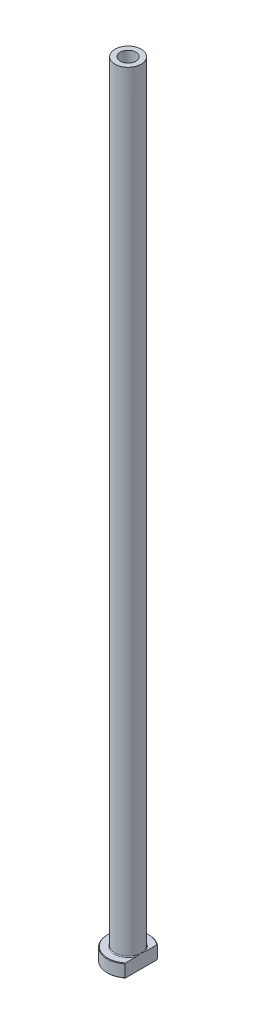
ISO-10303-21;
HEADER;
FILE_DESCRIPTION(('STEP AP214'),'2;1');
FILE_NAME('part.step','',(''),(''),'','','');
FILE_SCHEMA(('AUTOMOTIVE_DESIGN { 1 0 10303 214 1 1 1 1 }'));
ENDSEC;
DATA;
#1=APPLICATION_CONTEXT('core data for automotive mechanical design processes');
#2=APPLICATION_PROTOCOL_DEFINITION('international standard','automotive_design',2000,#1);
#3=PRODUCT_CONTEXT('',#1,'mechanical');
#4=PRODUCT('Part','Part','',(#3));
#5=PRODUCT_RELATED_PRODUCT_CATEGORY('part','',(#4));
#6=PRODUCT_DEFINITION_FORMATION('','',#4);
#7=PRODUCT_DEFINITION_CONTEXT('part definition',#1,'design');
#8=PRODUCT_DEFINITION('design','',#6,#7);
#9=PRODUCT_DEFINITION_SHAPE('','',#8);
#10=(LENGTH_UNIT() NAMED_UNIT(*) SI_UNIT(.MILLI.,.METRE.));
#11=(NAMED_UNIT(*) PLANE_ANGLE_UNIT() SI_UNIT($,.RADIAN.));
#12=(NAMED_UNIT(*) SI_UNIT($,.STERADIAN.) SOLID_ANGLE_UNIT());
#13=UNCERTAINTY_MEASURE_WITH_UNIT(LENGTH_MEASURE(1.E-05),#10,'distance_accuracy_value','');
#14=(GEOMETRIC_REPRESENTATION_CONTEXT(3) GLOBAL_UNCERTAINTY_ASSIGNED_CONTEXT((#13)) GLOBAL_UNIT_ASSIGNED_CONTEXT((#10,
#11,#12)) REPRESENTATION_CONTEXT('',''));
#15=CARTESIAN_POINT('',(0.,0.,0.));
#16=DIRECTION('',(0.,0.,1.));
#17=DIRECTION('',(1.,0.,0.));
#18=AXIS2_PLACEMENT_3D('',#15,#16,#17);
#19=CARTESIAN_POINT('',(0.,92.1876809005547,0.));
#20=DIRECTION('',(0.,1.,0.));
#21=DIRECTION('',(0.,0.,1.));
#22=AXIS2_PLACEMENT_3D('',#19,#20,#21);
#23=CYLINDRICAL_SURFACE('',#22,3.00000000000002);
#24=CARTESIAN_POINT('',(0.,300.,0.));
#25=DIRECTION('',(0.,1.,0.));
#26=DIRECTION('',(0.,0.,1.));
#27=AXIS2_PLACEMENT_3D('',#24,#25,#26);
#28=CIRCLE('',#27,3.00000000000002);
#29=CARTESIAN_POINT('',(0.,300.,3.00000000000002));
#30=VERTEX_POINT('',#29);
#31=EDGE_CURVE('E167',#30,#30,#28,.T.);
#32=ORIENTED_EDGE('',*,*,#31,.T.);
#33=EDGE_LOOP('',(#32));
#34=FACE_BOUND('',#33,.T.);
#35=CARTESIAN_POINT('',(0.,255.,0.));
#36=DIRECTION('',(0.,1.,0.));
#37=DIRECTION('',(0.,0.,1.));
#38=AXIS2_PLACEMENT_3D('',#35,#36,#37);
#39=CIRCLE('',#38,3.00000000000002);
#40=CARTESIAN_POINT('',(0.,255.,3.00000000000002));
#41=VERTEX_POINT('',#40);
#42=EDGE_CURVE('E170',#41,#41,#39,.T.);
#43=ORIENTED_EDGE('',*,*,#42,.F.);
#44=EDGE_LOOP('',(#43));
#45=FACE_BOUND('',#44,.T.);
#46=ADVANCED_FACE('F32',(#34,#45),#23,.F.);
#47=CARTESIAN_POINT('',(-3.00000000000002,300.,0.));
#48=DIRECTION('',(0.,1.,0.));
#49=DIRECTION('',(0.,0.,1.));
#50=AXIS2_PLACEMENT_3D('',#47,#48,#49);
#51=PLANE('',#50);
#52=CARTESIAN_POINT('',(0.,300.,0.));
#53=DIRECTION('',(0.,1.,0.));
#54=DIRECTION('',(0.,0.,1.));
#55=AXIS2_PLACEMENT_3D('',#52,#53,#54);
#56=CIRCLE('',#55,5.00000000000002);
#57=CARTESIAN_POINT('',(0.,300.,5.00000000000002));
#58=VERTEX_POINT('',#57);
#59=EDGE_CURVE('E174',#58,#58,#56,.T.);
#60=ORIENTED_EDGE('',*,*,#59,.T.);
#61=EDGE_LOOP('',(#60));
#62=FACE_BOUND('',#61,.T.);
#63=ORIENTED_EDGE('',*,*,#31,.F.);
#64=EDGE_LOOP('',(#63));
#65=FACE_BOUND('',#64,.T.);
#66=ADVANCED_FACE('F157',(#62,#65),#51,.T.);
#67=CARTESIAN_POINT('',(0.,92.1876809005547,0.));
#68=DIRECTION('',(0.,1.,0.));
#69=DIRECTION('',(0.,0.,1.));
#70=AXIS2_PLACEMENT_3D('',#67,#68,#69);
#71=CYLINDRICAL_SURFACE('',#70,5.00000000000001);
#72=CARTESIAN_POINT('',(0.,5.3,0.));
#73=DIRECTION('',(0.,1.,0.));
#74=DIRECTION('',(0.,0.,1.));
#75=AXIS2_PLACEMENT_3D('',#72,#73,#74);
#76=CIRCLE('',#75,5.00000000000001);
#77=CARTESIAN_POINT('',(5.,5.3,0.));
#78=VERTEX_POINT('',#77);
#79=EDGE_CURVE('E180',#78,#78,#76,.T.);
#80=ORIENTED_EDGE('',*,*,#79,.T.);
#81=EDGE_LOOP('',(#80));
#82=FACE_BOUND('',#81,.T.);
#83=ORIENTED_EDGE('',*,*,#59,.F.);
#84=EDGE_LOOP('',(#83));
#85=FACE_BOUND('',#84,.T.);
#86=ADVANCED_FACE('F162',(#82,#85),#71,.T.);
#87=CARTESIAN_POINT('',(-4.99999999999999,5.,0.));
#88=DIRECTION('',(0.,1.,0.));
#89=DIRECTION('',(0.,0.,1.));
#90=AXIS2_PLACEMENT_3D('',#87,#88,#89);
#91=PLANE('',#90);
#92=DIRECTION('',(0.,0.,1.));
#93=VECTOR('',#92,1.);
#94=CARTESIAN_POINT('',(5.,5.,0.));
#95=LINE('',#94,#93);
#96=CARTESIAN_POINT('',(5.,5.,-5.98665181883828));
#97=VERTEX_POINT('',#96);
#98=CARTESIAN_POINT('',(5.,5.,-1.75783958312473));
#99=VERTEX_POINT('',#98);
#100=EDGE_CURVE('E54',#97,#99,#95,.T.);
#101=ORIENTED_EDGE('',*,*,#100,.F.);
#102=CARTESIAN_POINT('',(0.,5.,0.));
#103=DIRECTION('',(0.,1.,0.));
#104=DIRECTION('',(0.,0.,1.));
#105=AXIS2_PLACEMENT_3D('',#102,#103,#104);
#106=CIRCLE('',#105,7.79999999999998);
#107=CARTESIAN_POINT('',(4.99999999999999,5.,5.98665181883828));
#108=VERTEX_POINT('',#107);
#109=EDGE_CURVE('E186',#97,#108,#106,.T.);
#110=ORIENTED_EDGE('',*,*,#109,.T.);
#111=CARTESIAN_POINT('',(5.,5.,1.75783958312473));
#112=VERTEX_POINT('',#111);
#113=EDGE_CURVE('E134',#112,#108,#95,.T.);
#114=ORIENTED_EDGE('',*,*,#113,.F.);
#115=CARTESIAN_POINT('',(0.,5.,0.));
#116=DIRECTION('',(0.,1.,0.));
#117=DIRECTION('',(0.,0.,1.));
#118=AXIS2_PLACEMENT_3D('',#115,#116,#117);
#119=CIRCLE('',#118,5.30000000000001);
#120=EDGE_CURVE('E183',#112,#99,#119,.F.);
#121=ORIENTED_EDGE('',*,*,#120,.T.);
#122=EDGE_LOOP('',(#101,#110,#114,#121));
#123=FACE_BOUND('',#122,.T.);
#124=ADVANCED_FACE('F197',(#123),#91,.T.);
#125=CARTESIAN_POINT('',(0.,92.1876809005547,0.));
#126=DIRECTION('',(0.,1.,0.));
#127=DIRECTION('',(0.,0.,1.));
#128=AXIS2_PLACEMENT_3D('',#125,#126,#127);
#129=CYLINDRICAL_SURFACE('',#128,7.99999999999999);
#130=DIRECTION('',(0.,-1.,0.));
#131=VECTOR('',#130,1.);
#132=CARTESIAN_POINT('',(4.99999999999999,300.,6.24499799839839));
#133=LINE('',#132,#131);
#134=CARTESIAN_POINT('',(4.99999999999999,4.79999999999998,6.24499799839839));
#135=VERTEX_POINT('',#134);
#136=CARTESIAN_POINT('',(4.99999999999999,0.199999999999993,6.24499799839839));
#137=VERTEX_POINT('',#136);
#138=EDGE_CURVE('E82',#135,#137,#133,.T.);
#139=ORIENTED_EDGE('',*,*,#138,.F.);
#140=CARTESIAN_POINT('',(0.,4.79999999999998,0.));
#141=DIRECTION('',(0.,1.,0.));
#142=DIRECTION('',(0.,0.,1.));
#143=AXIS2_PLACEMENT_3D('',#140,#141,#142);
#144=CIRCLE('',#143,7.99999999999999);
#145=CARTESIAN_POINT('',(5.,4.79999999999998,-6.24499799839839));
#146=VERTEX_POINT('',#145);
#147=EDGE_CURVE('E95',#135,#146,#144,.F.);
#148=ORIENTED_EDGE('',*,*,#147,.T.);
#149=DIRECTION('',(0.,-1.,0.));
#150=VECTOR('',#149,1.);
#151=CARTESIAN_POINT('',(5.,300.,-6.24499799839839));
#152=LINE('',#151,#150);
#153=CARTESIAN_POINT('',(5.,0.199999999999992,-6.24499799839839));
#154=VERTEX_POINT('',#153);
#155=EDGE_CURVE('E192',#146,#154,#152,.T.);
#156=ORIENTED_EDGE('',*,*,#155,.T.);
#157=CARTESIAN_POINT('',(0.,0.199999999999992,0.));
#158=DIRECTION('',(0.,-1.,0.));
#159=DIRECTION('',(0.,0.,-1.));
#160=AXIS2_PLACEMENT_3D('',#157,#158,#159);
#161=CIRCLE('',#160,7.99999999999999);
#162=EDGE_CURVE('E98',#154,#137,#161,.F.);
#163=ORIENTED_EDGE('',*,*,#162,.T.);
#164=EDGE_LOOP('',(#139,#148,#156,#163));
#165=FACE_BOUND('',#164,.T.);
#166=ADVANCED_FACE('F190',(#165),#129,.T.);
#167=CARTESIAN_POINT('',(-7.99999999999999,0.,0.));
#168=DIRECTION('',(0.,-1.,0.));
#169=DIRECTION('',(0.,0.,-1.));
#170=AXIS2_PLACEMENT_3D('',#167,#168,#169);
#171=PLANE('',#170);
#172=CARTESIAN_POINT('',(0.,0.,0.));
#173=DIRECTION('',(0.,-1.,0.));
#174=DIRECTION('',(0.,0.,-1.));
#175=AXIS2_PLACEMENT_3D('',#172,#173,#174);
#176=CIRCLE('',#175,3.74999999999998);
#177=CARTESIAN_POINT('',(0.,0.,-3.74999999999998));
#178=VERTEX_POINT('',#177);
#179=EDGE_CURVE('E40',#178,#178,#176,.F.);
#180=ORIENTED_EDGE('',*,*,#179,.T.);
#181=EDGE_LOOP('',(#180));
#182=FACE_BOUND('',#181,.T.);
#183=DIRECTION('',(0.,0.,-1.));
#184=VECTOR('',#183,1.);
#185=CARTESIAN_POINT('',(4.99999999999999,0.,6.24499799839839));
#186=LINE('',#185,#184);
#187=CARTESIAN_POINT('',(4.99999999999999,0.,5.98665181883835));
#188=VERTEX_POINT('',#187);
#189=CARTESIAN_POINT('',(5.,0.,-5.98665181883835));
#190=VERTEX_POINT('',#189);
#191=EDGE_CURVE('E47',#188,#190,#186,.T.);
#192=ORIENTED_EDGE('',*,*,#191,.F.);
#193=CARTESIAN_POINT('',(0.,0.,0.));
#194=DIRECTION('',(0.,-1.,0.));
#195=DIRECTION('',(0.,0.,-1.));
#196=AXIS2_PLACEMENT_3D('',#193,#194,#195);
#197=CIRCLE('',#196,7.80000000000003);
#198=EDGE_CURVE('E92',#188,#190,#197,.T.);
#199=ORIENTED_EDGE('',*,*,#198,.T.);
#200=EDGE_LOOP('',(#192,#199));
#201=FACE_BOUND('',#200,.T.);
#202=ADVANCED_FACE('F91',(#182,#201),#171,.T.);
#203=CARTESIAN_POINT('',(0.,92.1876809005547,0.));
#204=DIRECTION('',(0.,1.,0.));
#205=DIRECTION('',(0.,0.,1.));
#206=AXIS2_PLACEMENT_3D('',#203,#204,#205);
#207=CYLINDRICAL_SURFACE('',#206,3.25);
#208=CARTESIAN_POINT('',(0.,0.499999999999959,0.));
#209=DIRECTION('',(0.,-1.,0.));
#210=DIRECTION('',(0.,0.,-1.));
#211=AXIS2_PLACEMENT_3D('',#208,#209,#210);
#212=CIRCLE('',#211,3.25);
#213=CARTESIAN_POINT('',(0.,0.499999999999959,-3.25));
#214=VERTEX_POINT('',#213);
#215=EDGE_CURVE('E11',#214,#214,#212,.T.);
#216=ORIENTED_EDGE('',*,*,#215,.T.);
#217=EDGE_LOOP('',(#216));
#218=FACE_BOUND('',#217,.T.);
#219=CARTESIAN_POINT('',(0.,243.,0.));
#220=DIRECTION('',(0.,1.,0.));
#221=DIRECTION('',(0.,0.,1.));
#222=AXIS2_PLACEMENT_3D('',#219,#220,#221);
#223=CIRCLE('',#222,3.25000000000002);
#224=CARTESIAN_POINT('',(0.,243.,3.25000000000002));
#225=VERTEX_POINT('',#224);
#226=EDGE_CURVE('E172',#225,#225,#223,.T.);
#227=ORIENTED_EDGE('',*,*,#226,.T.);
#228=EDGE_LOOP('',(#227));
#229=FACE_BOUND('',#228,.T.);
#230=ADVANCED_FACE('F215',(#218,#229),#207,.F.);
#231=CARTESIAN_POINT('',(0.,243.,0.));
#232=DIRECTION('',(0.,-1.,0.));
#233=DIRECTION('',(0.,0.,-1.));
#234=AXIS2_PLACEMENT_3D('',#231,#232,#233);
#235=CONICAL_SURFACE('',#234,3.25000000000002,0.0208303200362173);
#236=ORIENTED_EDGE('',*,*,#42,.T.);
#237=EDGE_LOOP('',(#236));
#238=FACE_BOUND('',#237,.T.);
#239=ORIENTED_EDGE('',*,*,#226,.F.);
#240=EDGE_LOOP('',(#239));
#241=FACE_BOUND('',#240,.T.);
#242=ADVANCED_FACE('F111',(#238,#241),#235,.F.);
#243=CARTESIAN_POINT('',(0.,5.3,0.));
#244=DIRECTION('',(0.,1.,0.));
#245=DIRECTION('',(0.,0.,1.));
#246=AXIS2_PLACEMENT_3D('',#243,#244,#245);
#247=TOROIDAL_SURFACE('',#246,5.30000000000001,0.3);
#248=ORIENTED_EDGE('',*,*,#120,.F.);
#249=CARTESIAN_POINT('',(5.,5.3,0.));
#250=CARTESIAN_POINT('',(5.,5.30000062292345,-1.31469010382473E-10));
#251=CARTESIAN_POINT('',(5.,5.30000124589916,2.52759437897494E-07));
#252=CARTESIAN_POINT('',(5.,5.30000240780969,9.47164796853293E-07));
#253=CARTESIAN_POINT('',(5.,5.30000293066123,1.40594088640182E-06));
#254=CARTESIAN_POINT('',(5.,5.30000402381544,2.50637678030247E-06));
#255=CARTESIAN_POINT('',(5.,5.30000457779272,3.16588995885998E-06));
#256=CARTESIAN_POINT('',(5.,5.3000055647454,4.52860063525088E-06));
#257=CARTESIAN_POINT('',(5.,5.30000600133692,5.22939539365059E-06));
#258=CARTESIAN_POINT('',(5.,5.30000763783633,7.96122138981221E-06));
#259=CARTESIAN_POINT('',(5.,5.30000875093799,1.00477429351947E-05));
#260=CARTESIAN_POINT('',(5.,5.30001056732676,1.41660896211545E-05));
#261=CARTESIAN_POINT('',(5.,5.30001129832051,1.61861803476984E-05));
#262=CARTESIAN_POINT('',(5.,5.30001439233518,2.47865774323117E-05));
#263=CARTESIAN_POINT('',(5.,5.30001672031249,3.13830329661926E-05));
#264=CARTESIAN_POINT('',(5.,5.30002012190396,4.38084273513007E-05));
#265=CARTESIAN_POINT('',(5.,5.30002133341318,4.95992786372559E-05));
#266=CARTESIAN_POINT('',(4.99999999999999,5.30003020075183,9.27862687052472E-05));
#267=CARTESIAN_POINT('',(5.,5.30003696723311,0.000130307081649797));
#268=CARTESIAN_POINT('',(5.,5.30006659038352,0.000278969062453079));
#269=CARTESIAN_POINT('',(5.,5.30009481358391,0.000389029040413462));
#270=CARTESIAN_POINT('',(4.99999999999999,5.30020506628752,0.000826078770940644));
#271=CARTESIAN_POINT('',(5.,5.30028365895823,0.00115365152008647));
#272=CARTESIAN_POINT('',(5.,5.30059919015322,0.00245925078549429));
#273=CARTESIAN_POINT('',(5.,5.3008404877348,0.00343651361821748));
#274=CARTESIAN_POINT('',(4.99999999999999,5.30184626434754,0.00752058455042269));
#275=CARTESIAN_POINT('',(4.99999999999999,5.30260525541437,0.0106283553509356));
#276=CARTESIAN_POINT('',(5.,5.30996461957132,0.0407482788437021));
#277=CARTESIAN_POINT('',(5.,5.31658985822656,0.0677561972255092));
#278=CARTESIAN_POINT('',(4.99999999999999,5.32953319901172,0.120688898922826));
#279=CARTESIAN_POINT('',(5.,5.33585289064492,0.146613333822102));
#280=CARTESIAN_POINT('',(5.,5.34926050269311,0.20179565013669));
#281=CARTESIAN_POINT('',(5.,5.35634306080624,0.231054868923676));
#282=CARTESIAN_POINT('',(5.,5.37050252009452,0.289917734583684));
#283=CARTESIAN_POINT('',(5.,5.37757848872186,0.319521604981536));
#284=CARTESIAN_POINT('',(5.,5.39452602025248,0.391032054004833));
#285=CARTESIAN_POINT('',(5.,5.40434071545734,0.432952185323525));
#286=CARTESIAN_POINT('',(5.,5.42340141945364,0.515763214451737));
#287=CARTESIAN_POINT('',(5.,5.43265559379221,0.556652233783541));
#288=CARTESIAN_POINT('',(5.,5.45710553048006,0.667075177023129));
#289=CARTESIAN_POINT('',(5.,5.47194176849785,0.736689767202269));
#290=CARTESIAN_POINT('',(5.,5.5001822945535,0.876836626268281));
#291=CARTESIAN_POINT('',(5.,5.51357312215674,0.947371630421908));
#292=CARTESIAN_POINT('',(5.,5.53930921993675,1.0949732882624));
#293=CARTESIAN_POINT('',(5.,5.5514621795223,1.17207432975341));
#294=CARTESIAN_POINT('',(5.,5.57239669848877,1.32672649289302));
#295=CARTESIAN_POINT('',(5.,5.58117877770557,1.40427754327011));
#296=CARTESIAN_POINT('',(5.,5.59499725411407,1.56873827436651));
#297=CARTESIAN_POINT('',(5.,5.59948802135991,1.65570044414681));
#298=CARTESIAN_POINT('',(5.,5.60018885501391,1.78535304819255));
#299=CARTESIAN_POINT('',(5.,5.59945214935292,1.82802575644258));
#300=CARTESIAN_POINT('',(5.,5.59559364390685,1.91325081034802));
#301=CARTESIAN_POINT('',(5.,5.59247319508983,1.95580321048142));
#302=CARTESIAN_POINT('',(5.,5.58383242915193,2.03512365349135));
#303=CARTESIAN_POINT('',(5.,5.57867386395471,2.07192937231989));
#304=CARTESIAN_POINT('',(5.,5.56543793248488,2.14526756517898));
#305=CARTESIAN_POINT('',(5.,5.55734203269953,2.18179676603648));
#306=CARTESIAN_POINT('',(5.,5.53718005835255,2.25427226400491));
#307=CARTESIAN_POINT('',(5.,5.52507057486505,2.29020746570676));
#308=CARTESIAN_POINT('',(5.,5.50270928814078,2.34223029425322));
#309=CARTESIAN_POINT('',(5.,5.4945781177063,2.35922314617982));
#310=CARTESIAN_POINT('',(5.,5.47657809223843,2.39224900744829));
#311=CARTESIAN_POINT('',(5.,5.4667128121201,2.40828390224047));
#312=CARTESIAN_POINT('',(5.,5.44695893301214,2.4357946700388));
#313=CARTESIAN_POINT('',(5.,5.43745879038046,2.44754592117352));
#314=CARTESIAN_POINT('',(5.,5.41677914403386,2.46946476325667));
#315=CARTESIAN_POINT('',(5.,5.40560543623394,2.47963758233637));
#316=CARTESIAN_POINT('',(5.,5.38617750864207,2.49393642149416));
#317=CARTESIAN_POINT('',(5.,5.37851643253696,2.49886271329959));
#318=CARTESIAN_POINT('',(5.,5.36252740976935,2.50749953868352));
#319=CARTESIAN_POINT('',(5.,5.35419984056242,2.51121075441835));
#320=CARTESIAN_POINT('',(5.,5.33690648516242,2.51712941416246));
#321=CARTESIAN_POINT('',(5.,5.32793451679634,2.51931927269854));
#322=CARTESIAN_POINT('',(5.,5.3097357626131,2.52185978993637));
#323=CARTESIAN_POINT('',(5.,5.30050931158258,2.52221275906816));
#324=CARTESIAN_POINT('',(5.,5.28349166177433,2.52112455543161));
#325=CARTESIAN_POINT('',(5.,5.2756832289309,2.51993178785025));
#326=CARTESIAN_POINT('',(5.,5.26036860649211,2.51628294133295));
#327=CARTESIAN_POINT('',(5.,5.25286261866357,2.51382603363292));
#328=CARTESIAN_POINT('',(5.,5.23590266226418,2.50685484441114));
#329=CARTESIAN_POINT('',(5.,5.22661875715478,2.50192984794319));
#330=CARTESIAN_POINT('',(5.,5.20895514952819,2.49066548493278));
#331=CARTESIAN_POINT('',(5.,5.20057756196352,2.48432291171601));
#332=CARTESIAN_POINT('',(5.,5.17987008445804,2.46645212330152));
#333=CARTESIAN_POINT('',(5.,5.16824151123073,2.45411867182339));
#334=CARTESIAN_POINT('',(5.,5.14692461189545,2.42790849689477));
#335=CARTESIAN_POINT('',(5.,5.13723987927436,2.41402898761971));
#336=CARTESIAN_POINT('',(5.,5.11080706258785,2.37143175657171));
#337=CARTESIAN_POINT('',(5.,5.09628770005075,2.34134703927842));
#338=CARTESIAN_POINT('',(5.,5.07130349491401,2.27940731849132));
#339=CARTESIAN_POINT('',(5.,5.06087110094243,2.24754035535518));
#340=CARTESIAN_POINT('',(5.,5.03890359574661,2.16787245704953));
#341=CARTESIAN_POINT('',(5.,5.02913523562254,2.11959065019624));
#342=CARTESIAN_POINT('',(5.,5.01416953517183,2.02224928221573));
#343=CARTESIAN_POINT('',(5.,5.00898637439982,1.97318778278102));
#344=CARTESIAN_POINT('',(5.,5.00220823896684,1.87635767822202));
#345=CARTESIAN_POINT('',(5.,5.00050709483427,1.82859609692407));
#346=CARTESIAN_POINT('',(5.,4.99969104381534,1.73330165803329));
#347=CARTESIAN_POINT('',(5.,5.00056327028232,1.6857688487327));
#348=CARTESIAN_POINT('',(5.,5.00484296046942,1.57937770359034));
#349=CARTESIAN_POINT('',(5.,5.00880932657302,1.52054285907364));
#350=CARTESIAN_POINT('',(5.,5.01925964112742,1.40312974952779));
#351=CARTESIAN_POINT('',(5.,5.0257426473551,1.34455139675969));
#352=CARTESIAN_POINT('',(5.,5.04090087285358,1.22627662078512));
#353=CARTESIAN_POINT('',(5.,5.0496242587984,1.16658647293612));
#354=CARTESIAN_POINT('',(5.,5.06877923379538,1.04732463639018));
#355=CARTESIAN_POINT('',(5.,5.07921523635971,0.987753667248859));
#356=CARTESIAN_POINT('',(5.,5.10551698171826,0.846936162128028));
#357=CARTESIAN_POINT('',(5.,5.12196565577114,0.765799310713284));
#358=CARTESIAN_POINT('',(5.,5.15639716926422,0.604819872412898));
#359=CARTESIAN_POINT('',(4.99999999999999,5.17436050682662,0.52497303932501));
#360=CARTESIAN_POINT('',(5.,5.20921667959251,0.374726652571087));
#361=CARTESIAN_POINT('',(5.,5.225993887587,0.304300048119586));
#362=CARTESIAN_POINT('',(4.99999999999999,5.25191105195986,0.196907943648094));
#363=CARTESIAN_POINT('',(4.99999999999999,5.26090146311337,0.159905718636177));
#364=CARTESIAN_POINT('',(5.,5.27881854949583,0.0865164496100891));
#365=CARTESIAN_POINT('',(5.00000000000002,5.28774391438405,0.0501291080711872));
#366=CARTESIAN_POINT('',(4.99999999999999,5.2973962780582,0.0106218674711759));
#367=CARTESIAN_POINT('',(4.99999999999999,5.29815688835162,0.00750762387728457));
#368=CARTESIAN_POINT('',(5.,5.29916304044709,0.00342209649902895));
#369=CARTESIAN_POINT('',(5.,5.29940309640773,0.00244985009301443));
#370=CARTESIAN_POINT('',(4.99999999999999,5.29971711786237,0.00115049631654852));
#371=CARTESIAN_POINT('',(4.99999999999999,5.29979541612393,0.000824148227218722));
#372=CARTESIAN_POINT('',(5.,5.29990531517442,0.000388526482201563));
#373=CARTESIAN_POINT('',(5.,5.29993348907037,0.000278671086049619));
#374=CARTESIAN_POINT('',(4.99999999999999,5.29996306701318,0.000130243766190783));
#375=CARTESIAN_POINT('',(4.99999999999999,5.2999698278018,9.27511452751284E-05));
#376=CARTESIAN_POINT('',(5.,5.29997868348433,4.95929937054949E-05));
#377=CARTESIAN_POINT('',(5.,5.2999798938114,4.38036608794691E-05));
#378=CARTESIAN_POINT('',(5.,5.29998329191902,3.13814231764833E-05));
#379=CARTESIAN_POINT('',(5.,5.29998561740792,2.47865253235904E-05));
#380=CARTESIAN_POINT('',(5.,5.29998870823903,1.61877567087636E-05));
#381=CARTESIAN_POINT('',(5.,5.29998943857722,1.41677791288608E-05));
#382=CARTESIAN_POINT('',(5.,5.29999125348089,1.00495550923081E-05));
#383=CARTESIAN_POINT('',(5.,5.29999236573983,7.96302814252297E-06));
#384=CARTESIAN_POINT('',(5.,5.29999400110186,5.23107510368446E-06));
#385=CARTESIAN_POINT('',(5.,5.2999944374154,4.53021132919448E-06));
#386=CARTESIAN_POINT('',(5.,5.29999542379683,3.16731243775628E-06));
#387=CARTESIAN_POINT('',(5.,5.29999597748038,2.50767799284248E-06));
#388=CARTESIAN_POINT('',(5.,5.29999707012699,1.40695930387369E-06));
#389=CARTESIAN_POINT('',(5.,5.29999759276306,9.48032903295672E-07));
#390=CARTESIAN_POINT('',(5.,5.29999875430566,2.53244546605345E-07));
#391=CARTESIAN_POINT('',(5.,5.29999937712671,1.31459812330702E-10));
#392=CARTESIAN_POINT('',(5.,5.3,0.));
#393=B_SPLINE_CURVE_WITH_KNOTS('',3,(#249,#250,#251,#252,#253,#254,#255,#256,#257,#258,#259,
#260,#261,#262,#263,#264,#265,#266,#267,#268,#269,#270,#271,#272,#273,#274,#275,#276,#277,#278,
#279,#280,#281,#282,#283,#284,#285,#286,#287,#288,#289,#290,#291,#292,#293,#294,#295,#296,#297,
#298,#299,#300,#301,#302,#303,#304,#305,#306,#307,#308,#309,#310,#311,#312,#313,#314,#315,#316,
#317,#318,#319,#320,#321,#322,#323,#324,#325,#326,#327,#328,#329,#330,#331,#332,#333,#334,#335,
#336,#337,#338,#339,#340,#341,#342,#343,#344,#345,#346,#347,#348,#349,#350,#351,#352,#353,#354,
#355,#356,#357,#358,#359,#360,#361,#362,#363,#364,#365,#366,#367,#368,#369,#370,#371,#372,#373,
#374,#375,#376,#377,#378,#379,#380,#381,#382,#383,#384,#385,#386,#387,#388,#389,#390,#391,#392),
.UNSPECIFIED.,.T.,.F.,(4,2,2,2,2,2,2,2,2,2,2,2,2,2,2,2,2,2,2,2,2,2,2,2,2,2,2,2,2,2,2,2,2,2,2,2,
2,2,2,2,2,2,2,2,2,2,2,2,2,2,2,2,2,2,2,2,2,2,2,2,2,2,2,2,2,2,2,2,2,2,2,4),(0.,
1.88939046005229E-06,3.98058434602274E-06,6.54817954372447E-06,9.02403619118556E-06,
1.60938663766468E-05,2.25328087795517E-05,4.34843817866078E-05,6.12120063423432E-05,
0.00017562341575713,0.000516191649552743,0.00152710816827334,0.00454656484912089,
0.0141443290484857,0.0975679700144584,0.17761933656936,0.267931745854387,0.359245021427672,
0.488405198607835,0.614173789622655,0.827694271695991,1.04305715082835,1.27715608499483,
1.51121890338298,1.77214751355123,1.90013509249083,2.02805018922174,2.13945459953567,
2.25157451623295,2.3649489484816,2.42139235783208,2.47772074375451,2.5229380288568,
2.56800219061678,2.59524342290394,2.62246933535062,2.65000494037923,2.67750590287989,
2.70108948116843,2.72468854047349,2.75603978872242,2.78746268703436,2.83802806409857,
2.88868607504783,2.98834295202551,3.08877575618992,3.23618650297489,3.38405153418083,
3.52733651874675,3.66990630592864,3.84673903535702,4.02350562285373,4.20444776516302,
4.38586374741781,4.63419556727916,4.87971270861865,5.09690175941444,5.21113882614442,
5.32353360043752,5.33315137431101,5.33615533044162,5.33716246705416,5.33750240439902,
5.3376167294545,5.33763445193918,5.33765539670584,5.33766183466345,5.33766890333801,
5.33767137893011,5.33767394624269,5.33767603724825,5.33767792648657),.UNSPECIFIED.);
#394=EDGE_CURVE('E126',#112,#78,#393,.T.);
#395=ORIENTED_EDGE('',*,*,#394,.T.);
#396=ORIENTED_EDGE('',*,*,#79,.F.);
#397=CARTESIAN_POINT('',(5.,5.3,0.));
#398=CARTESIAN_POINT('',(5.,5.29999937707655,1.31470487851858E-10));
#399=CARTESIAN_POINT('',(5.,5.29999875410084,-2.52759436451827E-07));
#400=CARTESIAN_POINT('',(5.,5.29999759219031,-9.47164795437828E-07));
#401=CARTESIAN_POINT('',(5.,5.29999706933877,-1.40594088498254E-06));
#402=CARTESIAN_POINT('',(5.,5.29999597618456,-2.50637677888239E-06));
#403=CARTESIAN_POINT('',(5.,5.29999542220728,-3.16588995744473E-06));
#404=CARTESIAN_POINT('',(5.,5.29999443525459,-4.52860063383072E-06));
#405=CARTESIAN_POINT('',(5.,5.29999399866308,-5.22939539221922E-06));
#406=CARTESIAN_POINT('',(5.,5.29999236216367,-7.96122138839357E-06));
#407=CARTESIAN_POINT('',(5.,5.299991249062,-1.00477429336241E-05));
#408=CARTESIAN_POINT('',(5.,5.29998943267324,-1.4166089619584E-05));
#409=CARTESIAN_POINT('',(5.,5.29998870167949,-1.61861803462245E-05));
#410=CARTESIAN_POINT('',(5.,5.29998560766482,-2.47865774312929E-05));
#411=CARTESIAN_POINT('',(5.,5.29998327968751,-3.13830329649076E-05));
#412=CARTESIAN_POINT('',(5.,5.29997987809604,-4.38084273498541E-05));
#413=CARTESIAN_POINT('',(5.,5.29997866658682,-4.95992786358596E-05));
#414=CARTESIAN_POINT('',(5.,5.29996979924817,-9.27862687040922E-05));
#415=CARTESIAN_POINT('',(5.,5.29996303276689,-0.00013030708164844));
#416=CARTESIAN_POINT('',(4.99999999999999,5.29993340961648,-0.000278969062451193));
#417=CARTESIAN_POINT('',(4.99999999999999,5.29990518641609,-0.000389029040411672));
#418=CARTESIAN_POINT('',(5.,5.29979493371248,-0.000826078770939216));
#419=CARTESIAN_POINT('',(5.,5.29971634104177,-0.00115365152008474));
#420=CARTESIAN_POINT('',(4.99999999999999,5.29940080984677,-0.00245925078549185));
#421=CARTESIAN_POINT('',(4.99999999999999,5.29915951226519,-0.00343651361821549));
#422=CARTESIAN_POINT('',(5.00000000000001,5.29815373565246,-0.00752058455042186));
#423=CARTESIAN_POINT('',(5.,5.29739474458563,-0.0106283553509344));
#424=CARTESIAN_POINT('',(4.99999999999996,5.29003538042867,-0.0407482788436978));
#425=CARTESIAN_POINT('',(4.99999999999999,5.28341014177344,-0.0677561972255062));
#426=CARTESIAN_POINT('',(5.00000000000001,5.27046680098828,-0.120688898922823));
#427=CARTESIAN_POINT('',(5.,5.26414710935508,-0.146613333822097));
#428=CARTESIAN_POINT('',(4.99999999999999,5.25073949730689,-0.201795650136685));
#429=CARTESIAN_POINT('',(4.99999999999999,5.24365693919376,-0.231054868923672));
#430=CARTESIAN_POINT('',(5.,5.22949747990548,-0.289917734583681));
#431=CARTESIAN_POINT('',(5.,5.22242151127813,-0.319521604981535));
#432=CARTESIAN_POINT('',(5.,5.20547397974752,-0.391032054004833));
#433=CARTESIAN_POINT('',(5.,5.19565928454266,-0.432952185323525));
#434=CARTESIAN_POINT('',(5.,5.17659858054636,-0.515763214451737));
#435=CARTESIAN_POINT('',(5.,5.16734440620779,-0.55665223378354));
#436=CARTESIAN_POINT('',(5.,5.14289446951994,-0.667075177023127));
#437=CARTESIAN_POINT('',(5.,5.12805823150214,-0.736689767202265));
#438=CARTESIAN_POINT('',(5.,5.0998177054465,-0.876836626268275));
#439=CARTESIAN_POINT('',(5.,5.08642687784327,-0.947371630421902));
#440=CARTESIAN_POINT('',(5.,5.06069078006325,-1.0949732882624));
#441=CARTESIAN_POINT('',(5.,5.0485378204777,-1.1720743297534));
#442=CARTESIAN_POINT('',(5.,5.02760330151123,-1.32672649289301));
#443=CARTESIAN_POINT('',(5.,5.01882122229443,-1.4042775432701));
#444=CARTESIAN_POINT('',(5.,5.00500274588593,-1.56873827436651));
#445=CARTESIAN_POINT('',(5.,5.00051197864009,-1.6557004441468));
#446=CARTESIAN_POINT('',(5.,4.99981114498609,-1.78535304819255));
#447=CARTESIAN_POINT('',(5.,5.00054785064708,-1.82802575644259));
#448=CARTESIAN_POINT('',(5.,5.00440635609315,-1.91325081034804));
#449=CARTESIAN_POINT('',(5.,5.00752680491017,-1.95580321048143));
#450=CARTESIAN_POINT('',(5.,5.01616757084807,-2.03512365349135));
#451=CARTESIAN_POINT('',(5.,5.02132613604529,-2.0719293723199));
#452=CARTESIAN_POINT('',(5.,5.03456206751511,-2.14526756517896));
#453=CARTESIAN_POINT('',(5.,5.04265796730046,-2.18179676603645));
#454=CARTESIAN_POINT('',(5.,5.06281994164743,-2.25427226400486));
#455=CARTESIAN_POINT('',(5.,5.07492942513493,-2.2902074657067));
#456=CARTESIAN_POINT('',(5.,5.09729071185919,-2.34223029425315));
#457=CARTESIAN_POINT('',(5.,5.10542188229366,-2.35922314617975));
#458=CARTESIAN_POINT('',(5.,5.12342190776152,-2.39224900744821));
#459=CARTESIAN_POINT('',(5.,5.13328718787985,-2.4082839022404));
#460=CARTESIAN_POINT('',(5.,5.1530410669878,-2.43579467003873));
#461=CARTESIAN_POINT('',(5.,5.16254120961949,-2.44754592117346));
#462=CARTESIAN_POINT('',(5.,5.18322085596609,-2.46946476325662));
#463=CARTESIAN_POINT('',(5.,5.19439456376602,-2.47963758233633));
#464=CARTESIAN_POINT('',(5.,5.21382249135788,-2.49393642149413));
#465=CARTESIAN_POINT('',(5.,5.22148356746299,-2.49886271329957));
#466=CARTESIAN_POINT('',(5.,5.2374725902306,-2.50749953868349));
#467=CARTESIAN_POINT('',(5.,5.24580015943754,-2.51121075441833));
#468=CARTESIAN_POINT('',(5.,5.26309351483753,-2.51712941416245));
#469=CARTESIAN_POINT('',(5.,5.27206548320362,-2.51931927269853));
#470=CARTESIAN_POINT('',(5.,5.29026423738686,-2.52185978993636));
#471=CARTESIAN_POINT('',(5.,5.29949068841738,-2.52221275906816));
#472=CARTESIAN_POINT('',(5.,5.31650833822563,-2.52112455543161));
#473=CARTESIAN_POINT('',(5.,5.32431677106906,-2.51993178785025));
#474=CARTESIAN_POINT('',(5.,5.33963139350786,-2.51628294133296));
#475=CARTESIAN_POINT('',(5.,5.3471373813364,-2.51382603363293));
#476=CARTESIAN_POINT('',(5.,5.36409733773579,-2.50685484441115));
#477=CARTESIAN_POINT('',(5.,5.37338124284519,-2.50192984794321));
#478=CARTESIAN_POINT('',(5.,5.39104485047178,-2.4906654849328));
#479=CARTESIAN_POINT('',(5.,5.39942243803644,-2.48432291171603));
#480=CARTESIAN_POINT('',(5.,5.42012991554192,-2.46645212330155));
#481=CARTESIAN_POINT('',(5.,5.43175848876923,-2.45411867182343));
#482=CARTESIAN_POINT('',(5.,5.45307538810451,-2.42790849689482));
#483=CARTESIAN_POINT('',(5.,5.4627601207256,-2.41402898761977));
#484=CARTESIAN_POINT('',(5.,5.48919293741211,-2.37143175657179));
#485=CARTESIAN_POINT('',(5.,5.5037122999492,-2.34134703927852));
#486=CARTESIAN_POINT('',(5.,5.52869650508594,-2.27940731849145));
#487=CARTESIAN_POINT('',(5.,5.53912889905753,-2.24754035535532));
#488=CARTESIAN_POINT('',(5.,5.56109640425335,-2.16787245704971));
#489=CARTESIAN_POINT('',(5.,5.57086476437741,-2.11959065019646));
#490=CARTESIAN_POINT('',(5.,5.58583046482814,-2.02224928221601));
#491=CARTESIAN_POINT('',(5.,5.59101362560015,-1.97318778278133));
#492=CARTESIAN_POINT('',(5.,5.59779176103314,-1.87635767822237));
#493=CARTESIAN_POINT('',(5.,5.59949290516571,-1.82859609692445));
#494=CARTESIAN_POINT('',(5.,5.60030895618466,-1.73330165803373));
#495=CARTESIAN_POINT('',(5.,5.59943672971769,-1.68576884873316));
#496=CARTESIAN_POINT('',(5.,5.5951570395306,-1.57937770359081));
#497=CARTESIAN_POINT('',(5.,5.59119067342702,-1.52054285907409));
#498=CARTESIAN_POINT('',(5.,5.58074035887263,-1.40312974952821));
#499=CARTESIAN_POINT('',(5.,5.57425735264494,-1.34455139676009));
#500=CARTESIAN_POINT('',(5.,5.55909912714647,-1.22627662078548));
#501=CARTESIAN_POINT('',(5.,5.55037574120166,-1.16658647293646));
#502=CARTESIAN_POINT('',(5.,5.53122076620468,-1.04732463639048));
#503=CARTESIAN_POINT('',(5.,5.52078476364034,-0.987753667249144));
#504=CARTESIAN_POINT('',(5.,5.49448301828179,-0.846936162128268));
#505=CARTESIAN_POINT('',(4.99999999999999,5.4780343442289,-0.765799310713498));
#506=CARTESIAN_POINT('',(5.,5.44360283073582,-0.604819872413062));
#507=CARTESIAN_POINT('',(5.,5.42563949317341,-0.52497303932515));
#508=CARTESIAN_POINT('',(4.99999999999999,5.39078332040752,-0.374726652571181));
#509=CARTESIAN_POINT('',(4.99999999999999,5.37400611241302,-0.304300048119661));
#510=CARTESIAN_POINT('',(5.,5.34808894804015,-0.196907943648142));
#511=CARTESIAN_POINT('',(5.00000000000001,5.33909853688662,-0.159905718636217));
#512=CARTESIAN_POINT('',(4.99999999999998,5.32118145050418,-0.0865164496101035));
#513=CARTESIAN_POINT('',(4.99999999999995,5.312256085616,-0.0501291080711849));
#514=CARTESIAN_POINT('',(5.,5.3026037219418,-0.0106218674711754));
#515=CARTESIAN_POINT('',(5.,5.30184311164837,-0.00750762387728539));
#516=CARTESIAN_POINT('',(4.99999999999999,5.3008369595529,-0.00342209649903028));
#517=CARTESIAN_POINT('',(4.99999999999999,5.30059690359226,-0.00244985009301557));
#518=CARTESIAN_POINT('',(5.,5.30028288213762,-0.00115049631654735));
#519=CARTESIAN_POINT('',(5.,5.30020458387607,-0.000824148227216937));
#520=CARTESIAN_POINT('',(4.99999999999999,5.30009468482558,-0.000388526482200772));
#521=CARTESIAN_POINT('',(4.99999999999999,5.30006651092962,-0.000278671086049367));
#522=CARTESIAN_POINT('',(5.,5.30003693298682,-0.000130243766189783));
#523=CARTESIAN_POINT('',(5.,5.3000301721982,-9.27511452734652E-05));
#524=CARTESIAN_POINT('',(5.,5.30002131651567,-4.95929937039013E-05));
#525=CARTESIAN_POINT('',(5.,5.30002010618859,-4.38036608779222E-05));
#526=CARTESIAN_POINT('',(5.,5.30001670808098,-3.13814231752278E-05));
#527=CARTESIAN_POINT('',(5.,5.30001438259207,-2.4786525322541E-05));
#528=CARTESIAN_POINT('',(5.,5.30001129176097,-1.61877567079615E-05));
#529=CARTESIAN_POINT('',(5.,5.30001056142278,-1.41677791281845E-05));
#530=CARTESIAN_POINT('',(5.,5.30000874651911,-1.0049555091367E-05));
#531=CARTESIAN_POINT('',(5.,5.30000763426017,-7.96302814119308E-06));
#532=CARTESIAN_POINT('',(5.,5.30000599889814,-5.23107510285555E-06));
#533=CARTESIAN_POINT('',(5.,5.3000055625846,-4.53021132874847E-06));
#534=CARTESIAN_POINT('',(5.,5.30000457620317,-3.16731243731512E-06));
#535=CARTESIAN_POINT('',(5.,5.30000402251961,-2.50767799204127E-06));
#536=CARTESIAN_POINT('',(5.,5.30000292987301,-1.40695930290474E-06));
#537=CARTESIAN_POINT('',(5.,5.30000240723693,-9.48032902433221E-07));
#538=CARTESIAN_POINT('',(5.,5.30000124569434,-2.53244545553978E-07));
#539=CARTESIAN_POINT('',(5.,5.30000062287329,-1.3145851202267E-10));
#540=CARTESIAN_POINT('',(5.,5.3,0.));
#541=B_SPLINE_CURVE_WITH_KNOTS('',3,(#397,#398,#399,#400,#401,#402,#403,#404,#405,#406,#407,
#408,#409,#410,#411,#412,#413,#414,#415,#416,#417,#418,#419,#420,#421,#422,#423,#424,#425,#426,
#427,#428,#429,#430,#431,#432,#433,#434,#435,#436,#437,#438,#439,#440,#441,#442,#443,#444,#445,
#446,#447,#448,#449,#450,#451,#452,#453,#454,#455,#456,#457,#458,#459,#460,#461,#462,#463,#464,
#465,#466,#467,#468,#469,#470,#471,#472,#473,#474,#475,#476,#477,#478,#479,#480,#481,#482,#483,
#484,#485,#486,#487,#488,#489,#490,#491,#492,#493,#494,#495,#496,#497,#498,#499,#500,#501,#502,
#503,#504,#505,#506,#507,#508,#509,#510,#511,#512,#513,#514,#515,#516,#517,#518,#519,#520,#521,
#522,#523,#524,#525,#526,#527,#528,#529,#530,#531,#532,#533,#534,#535,#536,#537,#538,#539,#540),
.UNSPECIFIED.,.T.,.F.,(4,2,2,2,2,2,2,2,2,2,2,2,2,2,2,2,2,2,2,2,2,2,2,2,2,2,2,2,2,2,2,2,2,2,2,2,
2,2,2,2,2,2,2,2,2,2,2,2,2,2,2,2,2,2,2,2,2,2,2,2,2,2,2,2,2,2,2,2,2,2,2,4),(0.,
1.8893904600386E-06,3.98058434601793E-06,6.54817954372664E-06,9.02403619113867E-06,
1.60938663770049E-05,2.25328087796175E-05,4.34843817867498E-05,6.12120063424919E-05,
0.000175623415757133,0.000516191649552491,0.00152710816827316,0.00454656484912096,
0.0141443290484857,0.0975679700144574,0.177619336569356,0.267931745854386,0.359245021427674,
0.488405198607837,0.614173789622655,0.827694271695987,1.04305715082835,1.27715608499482,
1.51121890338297,1.77214751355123,1.90013509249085,2.02805018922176,2.13945459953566,
2.25157451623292,2.36494894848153,2.421392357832,2.47772074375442,2.52293802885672,
2.56800219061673,2.59524342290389,2.62246933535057,2.65000494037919,2.67750590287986,
2.7010894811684,2.72468854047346,2.75603978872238,2.78746268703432,2.8380280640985,
2.88868607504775,2.98834295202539,3.08877575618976,3.23618650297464,3.38405153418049,
3.52733651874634,3.66990630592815,3.84673903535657,4.02350562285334,4.20444776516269,
4.38586374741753,4.63419556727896,4.87971270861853,5.09690175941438,5.21113882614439,
5.32353360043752,5.33315137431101,5.33615533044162,5.33716246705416,5.33750240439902,
5.3376167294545,5.33763445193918,5.33765539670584,5.33766183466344,5.33766890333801,
5.3376713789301,5.33767394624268,5.33767603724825,5.33767792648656),.UNSPECIFIED.);
#542=EDGE_CURVE('E135',#78,#99,#541,.T.);
#543=ORIENTED_EDGE('',*,*,#542,.T.);
#544=EDGE_LOOP('',(#248,#395,#396,#543));
#545=FACE_BOUND('',#544,.T.);
#546=ADVANCED_FACE('F141',(#545),#247,.F.);
#547=CARTESIAN_POINT('',(0.,5.,0.));
#548=DIRECTION('',(0.,-1.,0.));
#549=DIRECTION('',(0.,0.,-1.));
#550=AXIS2_PLACEMENT_3D('',#547,#548,#549);
#551=CONICAL_SURFACE('',#550,7.79999999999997,0.78539816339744);
#552=CARTESIAN_POINT('',(5.,-1.82162423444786,-13.7401563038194));
#553=CARTESIAN_POINT('',(5.,-1.61889813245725,-13.5244204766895));
#554=CARTESIAN_POINT('',(5.,-1.4164638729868,-13.3084101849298));
#555=CARTESIAN_POINT('',(5.,-1.01227657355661,-12.8757508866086));
#556=CARTESIAN_POINT('',(5.,-0.810523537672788,-12.6591018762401));
#557=CARTESIAN_POINT('',(5.,-0.206157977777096,-12.0077661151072));
#558=CARTESIAN_POINT('',(5.,0.195280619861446,-11.5719884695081));
#559=CARTESIAN_POINT('',(5.,1.00388282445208,-10.6856136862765));
#560=CARTESIAN_POINT('',(5.,1.4109390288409,-10.2349182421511));
#561=CARTESIAN_POINT('',(5.,2.01658324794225,-9.55471676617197));
#562=CARTESIAN_POINT('',(5.,2.21758236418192,-9.32735800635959));
#563=CARTESIAN_POINT('',(5.,2.61761142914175,-8.87091599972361));
#564=CARTESIAN_POINT('',(5.,2.8166413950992,-8.64183276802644));
#565=CARTESIAN_POINT('',(5.,3.21217345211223,-8.18170099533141));
#566=CARTESIAN_POINT('',(5.,3.4086768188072,-7.95065355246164));
#567=CARTESIAN_POINT('',(5.,3.79865427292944,-7.48599989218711));
#568=CARTESIAN_POINT('',(5.,3.9921282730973,-7.25239360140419));
#569=CARTESIAN_POINT('',(5.,4.37558160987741,-6.78155890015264));
#570=CARTESIAN_POINT('',(5.,4.56555334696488,-6.54432428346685));
#571=CARTESIAN_POINT('',(5.,4.94042138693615,-6.06589574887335));
#572=CARTESIAN_POINT('',(5.,5.125318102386,-5.82470215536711));
#573=CARTESIAN_POINT('',(5.,5.48653546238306,-5.33972956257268));
#574=CARTESIAN_POINT('',(5.,5.66292392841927,-5.09600137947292));
#575=CARTESIAN_POINT('',(5.,6.00675382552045,-4.60213647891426));
#576=CARTESIAN_POINT('',(5.,6.1741916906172,-4.35199726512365));
#577=CARTESIAN_POINT('',(5.,6.49592993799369,-3.84445040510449));
#578=CARTESIAN_POINT('',(5.,6.65027272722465,-3.58707012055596));
#579=CARTESIAN_POINT('',(5.,6.86813414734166,-3.19356592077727));
#580=CARTESIAN_POINT('',(5.,6.93845533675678,-3.06120993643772));
#581=CARTESIAN_POINT('',(5.,7.07360441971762,-2.7937331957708));
#582=CARTESIAN_POINT('',(5.,7.13843319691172,-2.65861288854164));
#583=CARTESIAN_POINT('',(5.,7.26869642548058,-2.36936389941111));
#584=CARTESIAN_POINT('',(5.,7.33331212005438,-2.21486278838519));
#585=CARTESIAN_POINT('',(5.,7.45243473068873,-1.90194073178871));
#586=CARTESIAN_POINT('',(5.,7.50694001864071,-1.74351915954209));
#587=CARTESIAN_POINT('',(5.,7.60343746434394,-1.42384276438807));
#588=CARTESIAN_POINT('',(5.,7.64549910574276,-1.26260921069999));
#589=CARTESIAN_POINT('',(5.,7.71543089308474,-0.937062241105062));
#590=CARTESIAN_POINT('',(5.,7.74330266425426,-0.77274918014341));
#591=CARTESIAN_POINT('',(5.,7.78344284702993,-0.439876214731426));
#592=CARTESIAN_POINT('',(5.,7.79548961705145,-0.271289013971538));
#593=CARTESIAN_POINT('',(5.,7.80240809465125,0.0662275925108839));
#594=CARTESIAN_POINT('',(5.,7.79728142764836,0.235156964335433));
#595=CARTESIAN_POINT('',(5.,7.77017954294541,0.572209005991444));
#596=CARTESIAN_POINT('',(5.,7.74814735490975,0.74032700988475));
#597=CARTESIAN_POINT('',(5.,7.68863212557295,1.07379849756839));
#598=CARTESIAN_POINT('',(5.,7.65114437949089,1.23915112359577));
#599=CARTESIAN_POINT('',(5.,7.54734433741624,1.62344926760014));
#600=CARTESIAN_POINT('',(5.,7.47553580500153,1.84089917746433));
#601=CARTESIAN_POINT('',(5.,7.31300119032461,2.26856946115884));
#602=CARTESIAN_POINT('',(5.,7.22226460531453,2.47878574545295));
#603=CARTESIAN_POINT('',(5.,7.07492970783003,2.79014067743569));
#604=CARTESIAN_POINT('',(5.,7.02362278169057,2.89384077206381));
#605=CARTESIAN_POINT('',(5.,6.91783840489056,3.09961626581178));
#606=CARTESIAN_POINT('',(4.99999999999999,6.86336091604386,3.20169164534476));
#607=CARTESIAN_POINT('',(4.99999999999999,6.75169048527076,3.40428995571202));
#608=CARTESIAN_POINT('',(4.99999999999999,6.69449856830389,3.50481345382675));
#609=CARTESIAN_POINT('',(4.99999999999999,6.57774196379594,3.70446206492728));
#610=CARTESIAN_POINT('',(4.99999999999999,6.51817739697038,3.80358724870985));
#611=CARTESIAN_POINT('',(4.99999999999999,6.30853654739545,4.14435766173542));
#612=CARTESIAN_POINT('',(4.99999999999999,6.15326588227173,4.38281352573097));
#613=CARTESIAN_POINT('',(4.99999999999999,5.83377190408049,4.85367607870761));
#614=CARTESIAN_POINT('',(4.99999999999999,5.66954595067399,5.08608095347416));
#615=CARTESIAN_POINT('',(4.99999999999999,5.3343169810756,5.5462855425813));
#616=CARTESIAN_POINT('',(4.99999999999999,5.16330740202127,5.77408045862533));
#617=CARTESIAN_POINT('',(4.99999999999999,4.8162992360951,6.22578157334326));
#618=CARTESIAN_POINT('',(4.99999999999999,4.64030119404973,6.44968819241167));
#619=CARTESIAN_POINT('',(4.99999999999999,4.28368615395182,6.8953257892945));
#620=CARTESIAN_POINT('',(4.99999999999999,4.10305289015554,7.11704371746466));
#621=CARTESIAN_POINT('',(4.99999999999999,3.7387071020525,7.55793799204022));
#622=CARTESIAN_POINT('',(4.99999999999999,3.55499450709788,7.77711427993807));
#623=CARTESIAN_POINT('',(4.99999999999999,3.18521083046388,8.21325328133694));
#624=CARTESIAN_POINT('',(4.99999999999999,2.99914113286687,8.43021717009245));
#625=CARTESIAN_POINT('',(4.99999999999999,2.6249981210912,8.86241167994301));
#626=CARTESIAN_POINT('',(4.99999999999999,2.43692478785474,9.07764228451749));
#627=CARTESIAN_POINT('',(4.99999999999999,1.91463404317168,9.67075518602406));
#628=CARTESIAN_POINT('',(4.99999999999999,1.57868086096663,10.0471086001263));
#629=CARTESIAN_POINT('',(4.99999999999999,0.903003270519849,10.7965122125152));
#630=CARTESIAN_POINT('',(4.99999999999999,0.563278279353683,11.169561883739));
#631=CARTESIAN_POINT('',(4.99999999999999,-0.116149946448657,11.9100168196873));
#632=CARTESIAN_POINT('',(4.99999999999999,-0.455830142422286,12.2774432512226));
#633=CARTESIAN_POINT('',(4.99999999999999,-1.13728640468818,13.0102135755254));
#634=CARTESIAN_POINT('',(4.99999999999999,-1.47906204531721,13.3755578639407));
#635=CARTESIAN_POINT('',(4.99999999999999,-1.82162423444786,13.7401563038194));
#636=B_SPLINE_CURVE_WITH_KNOTS('',3,(#552,#553,#554,#555,#556,#557,#558,#559,#560,#561,#562,
#563,#564,#565,#566,#567,#568,#569,#570,#571,#572,#573,#574,#575,#576,#577,#578,#579,#580,#581,
#582,#583,#584,#585,#586,#587,#588,#589,#590,#591,#592,#593,#594,#595,#596,#597,#598,#599,#600,
#601,#602,#603,#604,#605,#606,#607,#608,#609,#610,#611,#612,#613,#614,#615,#616,#617,#618,#619,
#620,#621,#622,#623,#624,#625,#626,#627,#628,#629,#630,#631,#632,#633,#634,#635),.UNSPECIFIED.,
.F.,.F.,(4,2,2,2,2,2,2,2,2,2,2,2,2,2,2,2,2,2,2,2,2,2,2,2,2,2,2,2,2,2,2,2,2,2,2,2,2,2,2,2,2,4),
(0.,0.888120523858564,1.77624635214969,3.55372511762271,5.3755948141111,6.28598924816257,
7.19637570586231,8.10628289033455,9.016216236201,9.92793449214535,10.8395784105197,
11.7420025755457,12.6447836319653,13.5445196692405,13.9940505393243,14.4435089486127,
14.9456212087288,15.4478142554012,15.947147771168,16.4464240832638,16.952621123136,
17.458770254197,17.966632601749,18.4746496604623,19.160451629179,19.8466351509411,
20.193687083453,20.5407431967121,20.8876692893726,21.234577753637,22.087909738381,
22.9414946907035,23.7959266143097,24.6502655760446,25.5081848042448,26.3661237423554,
27.2235803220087,28.0810450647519,29.5944656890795,31.1081235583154,32.60926785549,
34.1101167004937),.UNSPECIFIED.);
#637=EDGE_CURVE('E133',#146,#97,#636,.T.);
#638=ORIENTED_EDGE('',*,*,#637,.F.);
#639=ORIENTED_EDGE('',*,*,#147,.F.);
#640=EDGE_CURVE('E118',#108,#135,#636,.T.);
#641=ORIENTED_EDGE('',*,*,#640,.F.);
#642=ORIENTED_EDGE('',*,*,#109,.F.);
#643=EDGE_LOOP('',(#638,#639,#641,#642));
#644=FACE_BOUND('',#643,.T.);
#645=ADVANCED_FACE('F145',(#644),#551,.T.);
#646=CARTESIAN_POINT('',(0.,0.199999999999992,0.));
#647=DIRECTION('',(0.,1.,0.));
#648=DIRECTION('',(0.,0.,1.));
#649=AXIS2_PLACEMENT_3D('',#646,#647,#648);
#650=CONICAL_SURFACE('',#649,7.99999999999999,0.78539816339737);
#651=CARTESIAN_POINT('',(4.99999999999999,6.82162423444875,13.7401563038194));
#652=CARTESIAN_POINT('',(4.99999999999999,6.61889813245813,13.5244204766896));
#653=CARTESIAN_POINT('',(4.99999999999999,6.41646387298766,13.3084101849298));
#654=CARTESIAN_POINT('',(4.99999999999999,6.01227657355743,12.8757508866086));
#655=CARTESIAN_POINT('',(4.99999999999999,5.81052353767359,12.6591018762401));
#656=CARTESIAN_POINT('',(4.99999999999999,5.20615797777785,12.0077661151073));
#657=CARTESIAN_POINT('',(4.99999999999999,4.80471938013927,11.5719884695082));
#658=CARTESIAN_POINT('',(4.99999999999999,3.99611717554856,10.6856136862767));
#659=CARTESIAN_POINT('',(4.99999999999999,3.58906097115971,10.2349182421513));
#660=CARTESIAN_POINT('',(4.99999999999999,2.98341675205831,9.5547167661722));
#661=CARTESIAN_POINT('',(4.99999999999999,2.78241763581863,9.32735800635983));
#662=CARTESIAN_POINT('',(4.99999999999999,2.38238857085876,8.87091599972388));
#663=CARTESIAN_POINT('',(4.99999999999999,2.1833586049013,8.64183276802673));
#664=CARTESIAN_POINT('',(4.99999999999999,1.78782654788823,8.18170099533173));
#665=CARTESIAN_POINT('',(4.99999999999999,1.59132318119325,7.95065355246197));
#666=CARTESIAN_POINT('',(4.99999999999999,1.20134572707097,7.48599989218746));
#667=CARTESIAN_POINT('',(4.99999999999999,1.0078717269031,7.25239360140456));
#668=CARTESIAN_POINT('',(4.99999999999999,0.624418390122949,6.78155890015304));
#669=CARTESIAN_POINT('',(4.99999999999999,0.434446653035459,6.54432428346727));
#670=CARTESIAN_POINT('',(4.99999999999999,0.0595786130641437,6.06589574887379));
#671=CARTESIAN_POINT('',(4.99999999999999,-0.125318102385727,5.82470215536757));
#672=CARTESIAN_POINT('',(4.99999999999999,-0.486535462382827,5.33972956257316));
#673=CARTESIAN_POINT('',(4.99999999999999,-0.662923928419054,5.09600137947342));
#674=CARTESIAN_POINT('',(4.99999999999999,-1.00675382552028,4.60213647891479));
#675=CARTESIAN_POINT('',(4.99999999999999,-1.17419169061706,4.35199726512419));
#676=CARTESIAN_POINT('',(4.99999999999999,-1.49592993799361,3.84445040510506));
#677=CARTESIAN_POINT('',(4.99999999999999,-1.65027272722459,3.58707012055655));
#678=CARTESIAN_POINT('',(4.99999999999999,-1.86813414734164,3.19356592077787));
#679=CARTESIAN_POINT('',(5.,-1.93845533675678,3.06120993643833));
#680=CARTESIAN_POINT('',(5.,-2.07360441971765,2.79373319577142));
#681=CARTESIAN_POINT('',(5.,-2.13843319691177,2.65861288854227));
#682=CARTESIAN_POINT('',(5.,-2.26869642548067,2.36936389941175));
#683=CARTESIAN_POINT('',(5.,-2.33331212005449,2.21486278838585));
#684=CARTESIAN_POINT('',(5.,-2.45243473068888,1.90194073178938));
#685=CARTESIAN_POINT('',(5.,-2.50694001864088,1.74351915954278));
#686=CARTESIAN_POINT('',(5.,-2.60343746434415,1.42384276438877));
#687=CARTESIAN_POINT('',(5.,-2.645499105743,1.2626092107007));
#688=CARTESIAN_POINT('',(5.,-2.71543089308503,0.937062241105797));
#689=CARTESIAN_POINT('',(5.,-2.74330266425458,0.772749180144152));
#690=CARTESIAN_POINT('',(5.,-2.7834428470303,0.439876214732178));
#691=CARTESIAN_POINT('',(5.,-2.79548961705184,0.271289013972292));
#692=CARTESIAN_POINT('',(5.,-2.8024080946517,-0.0662275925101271));
#693=CARTESIAN_POINT('',(5.,-2.79728142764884,-0.235156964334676));
#694=CARTESIAN_POINT('',(5.,-2.77017954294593,-0.572209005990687));
#695=CARTESIAN_POINT('',(5.,-2.74814735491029,-0.740327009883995));
#696=CARTESIAN_POINT('',(5.,-2.68863212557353,-1.07379849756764));
#697=CARTESIAN_POINT('',(5.,-2.65114437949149,-1.23915112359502));
#698=CARTESIAN_POINT('',(5.,-2.54734433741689,-1.62344926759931));
#699=CARTESIAN_POINT('',(5.,-2.47553580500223,-1.84089917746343));
#700=CARTESIAN_POINT('',(5.,-2.31300119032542,-2.26856946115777));
#701=CARTESIAN_POINT('',(5.,-2.2222646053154,-2.47878574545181));
#702=CARTESIAN_POINT('',(5.,-2.07492970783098,-2.79014067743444));
#703=CARTESIAN_POINT('',(5.,-2.02362278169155,-2.89384077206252));
#704=CARTESIAN_POINT('',(5.,-1.91783840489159,-3.09961626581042));
#705=CARTESIAN_POINT('',(5.,-1.86336091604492,-3.20169164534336));
#706=CARTESIAN_POINT('',(5.,-1.75169048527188,-3.40428995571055));
#707=CARTESIAN_POINT('',(5.,-1.69449856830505,-3.50481345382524));
#708=CARTESIAN_POINT('',(5.,-1.57774196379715,-3.7044620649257));
#709=CARTESIAN_POINT('',(5.,-1.51817739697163,-3.80358724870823));
#710=CARTESIAN_POINT('',(5.,-1.30853654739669,-4.14435766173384));
#711=CARTESIAN_POINT('',(5.,-1.15326588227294,-4.38281352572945));
#712=CARTESIAN_POINT('',(5.,-0.833771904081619,-4.85367607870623));
#713=CARTESIAN_POINT('',(5.,-0.669545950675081,-5.08608095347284));
#714=CARTESIAN_POINT('',(5.,-0.334316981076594,-5.5462855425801));
#715=CARTESIAN_POINT('',(5.,-0.163307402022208,-5.77408045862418));
#716=CARTESIAN_POINT('',(5.,0.18370076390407,-6.22578157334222));
#717=CARTESIAN_POINT('',(5.,0.35969880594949,-6.44968819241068));
#718=CARTESIAN_POINT('',(5.,0.716313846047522,-6.89532578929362));
#719=CARTESIAN_POINT('',(5.,0.896947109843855,-7.11704371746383));
#720=CARTESIAN_POINT('',(5.,1.26129289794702,-7.55793799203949));
#721=CARTESIAN_POINT('',(5.,1.4450054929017,-7.77711427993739));
#722=CARTESIAN_POINT('',(5.,1.81478916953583,-8.21325328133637));
#723=CARTESIAN_POINT('',(5.,2.0008588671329,-8.43021717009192));
#724=CARTESIAN_POINT('',(5.,2.3750018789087,-8.86241167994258));
#725=CARTESIAN_POINT('',(5.,2.56307521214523,-9.07764228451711));
#726=CARTESIAN_POINT('',(5.,3.08536595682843,-9.67075518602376));
#727=CARTESIAN_POINT('',(5.,3.42131913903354,-10.047108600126));
#728=CARTESIAN_POINT('',(5.,4.09699672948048,-10.796512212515));
#729=CARTESIAN_POINT('',(5.,4.43672172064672,-11.1695618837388));
#730=CARTESIAN_POINT('',(5.,5.1161499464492,-11.9100168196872));
#731=CARTESIAN_POINT('',(5.,5.4558301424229,-12.2774432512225));
#732=CARTESIAN_POINT('',(5.,6.13728640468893,-13.0102135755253));
#733=CARTESIAN_POINT('',(5.,6.47906204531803,-13.3755578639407));
#734=CARTESIAN_POINT('',(5.,6.82162423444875,-13.7401563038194));
#735=B_SPLINE_CURVE_WITH_KNOTS('',3,(#651,#652,#653,#654,#655,#656,#657,#658,#659,#660,#661,
#662,#663,#664,#665,#666,#667,#668,#669,#670,#671,#672,#673,#674,#675,#676,#677,#678,#679,#680,
#681,#682,#683,#684,#685,#686,#687,#688,#689,#690,#691,#692,#693,#694,#695,#696,#697,#698,#699,
#700,#701,#702,#703,#704,#705,#706,#707,#708,#709,#710,#711,#712,#713,#714,#715,#716,#717,#718,
#719,#720,#721,#722,#723,#724,#725,#726,#727,#728,#729,#730,#731,#732,#733,#734),.UNSPECIFIED.,
.F.,.F.,(4,2,2,2,2,2,2,2,2,2,2,2,2,2,2,2,2,2,2,2,2,2,2,2,2,2,2,2,2,2,2,2,2,2,2,2,2,2,2,2,2,4),
(0.,0.888120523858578,1.77624635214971,3.55372511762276,5.37559481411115,6.28598924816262,
7.19637570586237,8.10628289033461,9.01621623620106,9.92793449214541,10.8395784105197,
11.7420025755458,12.6447836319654,13.5445196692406,13.9940505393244,14.4435089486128,
14.9456212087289,15.4478142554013,15.9471477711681,16.4464240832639,16.952621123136,
17.458770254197,17.9666326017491,18.4746496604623,19.1604516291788,19.8466351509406,
20.1936870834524,20.5407431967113,20.8876692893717,21.234577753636,22.0879097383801,
22.9414946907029,23.7959266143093,24.6502655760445,25.5081848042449,26.3661237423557,
27.2235803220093,28.0810450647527,29.5944656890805,31.1081235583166,32.6092678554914,
34.1101167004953),.UNSPECIFIED.);
#736=EDGE_CURVE('E79',#137,#188,#735,.T.);
#737=ORIENTED_EDGE('',*,*,#736,.F.);
#738=ORIENTED_EDGE('',*,*,#162,.F.);
#739=EDGE_CURVE('E87',#190,#154,#735,.T.);
#740=ORIENTED_EDGE('',*,*,#739,.F.);
#741=ORIENTED_EDGE('',*,*,#198,.F.);
#742=EDGE_LOOP('',(#737,#738,#740,#741));
#743=FACE_BOUND('',#742,.T.);
#744=ADVANCED_FACE('F94',(#743),#650,.T.);
#745=CARTESIAN_POINT('',(4.99999999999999,300.,6.24499799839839));
#746=DIRECTION('',(-1.,0.,0.));
#747=DIRECTION('',(0.,0.,1.));
#748=AXIS2_PLACEMENT_3D('',#745,#746,#747);
#749=PLANE('',#748);
#750=ORIENTED_EDGE('',*,*,#394,.F.);
#751=ORIENTED_EDGE('',*,*,#113,.T.);
#752=ORIENTED_EDGE('',*,*,#640,.T.);
#753=ORIENTED_EDGE('',*,*,#138,.T.);
#754=ORIENTED_EDGE('',*,*,#736,.T.);
#755=ORIENTED_EDGE('',*,*,#191,.T.);
#756=ORIENTED_EDGE('',*,*,#739,.T.);
#757=ORIENTED_EDGE('',*,*,#155,.F.);
#758=ORIENTED_EDGE('',*,*,#637,.T.);
#759=ORIENTED_EDGE('',*,*,#100,.T.);
#760=ORIENTED_EDGE('',*,*,#542,.F.);
#761=EDGE_LOOP('',(#750,#751,#752,#753,#754,#755,#756,#757,#758,#759,#760));
#762=FACE_BOUND('',#761,.T.);
#763=ADVANCED_FACE('F80',(#762),#749,.F.);
#764=CARTESIAN_POINT('',(0.,0.,0.));
#765=DIRECTION('',(0.,-1.,0.));
#766=DIRECTION('',(0.,0.,-1.));
#767=AXIS2_PLACEMENT_3D('',#764,#765,#766);
#768=CONICAL_SURFACE('',#767,3.74999999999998,0.78539816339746);
#769=ORIENTED_EDGE('',*,*,#215,.F.);
#770=EDGE_LOOP('',(#769));
#771=FACE_BOUND('',#770,.T.);
#772=ORIENTED_EDGE('',*,*,#179,.F.);
#773=EDGE_LOOP('',(#772));
#774=FACE_BOUND('',#773,.T.);
#775=ADVANCED_FACE('F34',(#771,#774),#768,.F.);
#776=CLOSED_SHELL('',(#46,#66,#86,#124,#166,#202,#230,#242,#546,#645,#744,#763,#775));
#777=MANIFOLD_SOLID_BREP('B2',#776);
#778=ADVANCED_BREP_SHAPE_REPRESENTATION('',(#18,#777),#14);
#779=SHAPE_DEFINITION_REPRESENTATION(#9,#778);
ENDSEC;
END-ISO-10303-21;
